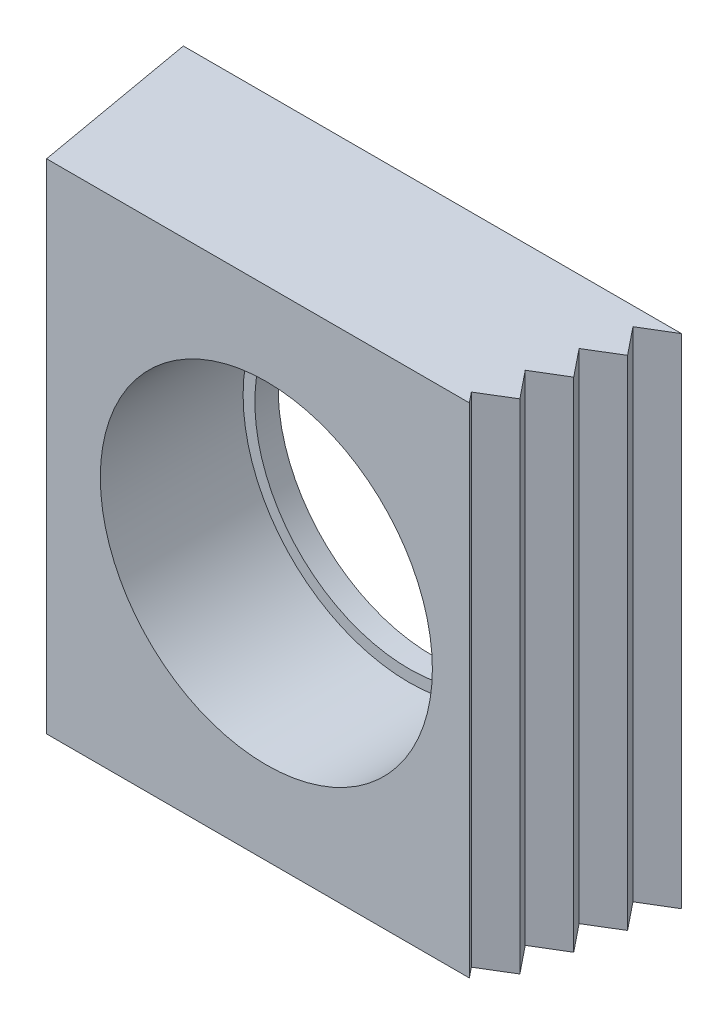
ISO-10303-21;
HEADER;
FILE_DESCRIPTION(('STEP AP214'),'2;1');
FILE_NAME('part.step','',(''),(''),'','','');
FILE_SCHEMA(('AUTOMOTIVE_DESIGN { 1 0 10303 214 1 1 1 1 }'));
ENDSEC;
DATA;
#1=APPLICATION_CONTEXT('core data for automotive mechanical design processes');
#2=APPLICATION_PROTOCOL_DEFINITION('international standard','automotive_design',2000,#1);
#3=PRODUCT_CONTEXT('',#1,'mechanical');
#4=PRODUCT('Part','Part','',(#3));
#5=PRODUCT_RELATED_PRODUCT_CATEGORY('part','',(#4));
#6=PRODUCT_DEFINITION_FORMATION('','',#4);
#7=PRODUCT_DEFINITION_CONTEXT('part definition',#1,'design');
#8=PRODUCT_DEFINITION('design','',#6,#7);
#9=PRODUCT_DEFINITION_SHAPE('','',#8);
#10=(LENGTH_UNIT() NAMED_UNIT(*) SI_UNIT(.MILLI.,.METRE.));
#11=(NAMED_UNIT(*) PLANE_ANGLE_UNIT() SI_UNIT($,.RADIAN.));
#12=(NAMED_UNIT(*) SI_UNIT($,.STERADIAN.) SOLID_ANGLE_UNIT());
#13=UNCERTAINTY_MEASURE_WITH_UNIT(LENGTH_MEASURE(1.E-05),#10,'distance_accuracy_value','');
#14=(GEOMETRIC_REPRESENTATION_CONTEXT(3) GLOBAL_UNCERTAINTY_ASSIGNED_CONTEXT((#13)) GLOBAL_UNIT_ASSIGNED_CONTEXT((#10,
#11,#12)) REPRESENTATION_CONTEXT('',''));
#15=CARTESIAN_POINT('',(0.,0.,0.));
#16=DIRECTION('',(0.,0.,1.));
#17=DIRECTION('',(1.,0.,0.));
#18=AXIS2_PLACEMENT_3D('',#15,#16,#17);
#19=CARTESIAN_POINT('',(9.525,-9.525,6.35));
#20=DIRECTION('',(0.,0.,1.));
#21=DIRECTION('',(0.,1.,0.));
#22=AXIS2_PLACEMENT_3D('',#19,#20,#21);
#23=PLANE('',#22);
#24=CARTESIAN_POINT('',(0.,0.,6.35));
#25=DIRECTION('',(0.,0.,1.));
#26=DIRECTION('',(0.,1.,0.));
#27=AXIS2_PLACEMENT_3D('',#24,#25,#26);
#28=CIRCLE('',#27,6.35);
#29=CARTESIAN_POINT('',(0.,6.35,6.35));
#30=VERTEX_POINT('',#29);
#31=EDGE_CURVE('E18',#30,#30,#28,.F.);
#32=ORIENTED_EDGE('',*,*,#31,.T.);
#33=EDGE_LOOP('',(#32));
#34=FACE_BOUND('',#33,.T.);
#35=DIRECTION('',(1.,0.,0.));
#36=VECTOR('',#35,1.);
#37=CARTESIAN_POINT('',(-9.525,-9.525,6.35));
#38=LINE('',#37,#36);
#39=CARTESIAN_POINT('',(-8.40532367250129,-9.525,6.35));
#40=VERTEX_POINT('',#39);
#41=CARTESIAN_POINT('',(7.76395811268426,-9.525,6.35));
#42=VERTEX_POINT('',#41);
#43=EDGE_CURVE('E23',#40,#42,#38,.T.);
#44=ORIENTED_EDGE('',*,*,#43,.T.);
#45=DIRECTION('',(0.,1.,0.));
#46=VECTOR('',#45,1.);
#47=CARTESIAN_POINT('',(7.76395811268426,-9.525,6.35));
#48=LINE('',#47,#46);
#49=CARTESIAN_POINT('',(7.76395811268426,9.525,6.35));
#50=VERTEX_POINT('',#49);
#51=EDGE_CURVE('E103',#42,#50,#48,.T.);
#52=ORIENTED_EDGE('',*,*,#51,.T.);
#53=DIRECTION('',(-1.,0.,0.));
#54=VECTOR('',#53,1.);
#55=CARTESIAN_POINT('',(-9.525,9.525,6.35));
#56=LINE('',#55,#54);
#57=CARTESIAN_POINT('',(-8.40532367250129,9.525,6.35));
#58=VERTEX_POINT('',#57);
#59=EDGE_CURVE('E9',#50,#58,#56,.T.);
#60=ORIENTED_EDGE('',*,*,#59,.T.);
#61=DIRECTION('',(0.,1.,0.));
#62=VECTOR('',#61,1.);
#63=CARTESIAN_POINT('',(-8.40532367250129,-9.525,6.35));
#64=LINE('',#63,#62);
#65=EDGE_CURVE('E96',#40,#58,#64,.T.);
#66=ORIENTED_EDGE('',*,*,#65,.F.);
#67=EDGE_LOOP('',(#44,#52,#60,#66));
#68=FACE_BOUND('',#67,.T.);
#69=ADVANCED_FACE('F14',(#34,#68),#23,.T.);
#70=CARTESIAN_POINT('',(-9.525,-9.525,6.35));
#71=DIRECTION('',(0.,1.,0.));
#72=DIRECTION('',(-1.,0.,0.));
#73=AXIS2_PLACEMENT_3D('',#70,#71,#72);
#74=PLANE('',#73);
#75=DIRECTION('',(0.855491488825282,0.,-0.517816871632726));
#76=VECTOR('',#75,1.);
#77=CARTESIAN_POINT('',(8.37006209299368,-9.525,0.699067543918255));
#78=LINE('',#77,#76);
#79=CARTESIAN_POINT('',(8.37006209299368,-9.525,0.699067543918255));
#80=VERTEX_POINT('',#79);
#81=CARTESIAN_POINT('',(9.525,-9.525,0.));
#82=VERTEX_POINT('',#81);
#83=EDGE_CURVE('E144',#80,#82,#78,.T.);
#84=ORIENTED_EDGE('',*,*,#83,.F.);
#85=DIRECTION('',(-0.626795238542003,0.,-0.779184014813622));
#86=VECTOR('',#85,1.);
#87=CARTESIAN_POINT('',(8.37006209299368,-9.525,0.699067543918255));
#88=LINE('',#87,#86);
#89=CARTESIAN_POINT('',(9.21625354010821,-9.525,1.75098818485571));
#90=VERTEX_POINT('',#89);
#91=EDGE_CURVE('E104',#90,#80,#88,.T.);
#92=ORIENTED_EDGE('',*,*,#91,.F.);
#93=DIRECTION('',(0.855491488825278,0.,-0.517816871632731));
#94=VECTOR('',#93,1.);
#95=CARTESIAN_POINT('',(8.06131563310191,-9.525,2.45005572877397));
#96=LINE('',#95,#94);
#97=CARTESIAN_POINT('',(8.06131563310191,-9.525,2.45005572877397));
#98=VERTEX_POINT('',#97);
#99=EDGE_CURVE('E191',#98,#90,#96,.T.);
#100=ORIENTED_EDGE('',*,*,#99,.F.);
#101=DIRECTION('',(-0.626795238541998,0.,-0.779184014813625));
#102=VECTOR('',#101,1.);
#103=CARTESIAN_POINT('',(8.06131563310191,-9.525,2.45005572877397));
#104=LINE('',#103,#102);
#105=CARTESIAN_POINT('',(8.90750708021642,-9.525,3.50197636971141));
#106=VERTEX_POINT('',#105);
#107=EDGE_CURVE('E188',#106,#98,#104,.T.);
#108=ORIENTED_EDGE('',*,*,#107,.F.);
#109=DIRECTION('',(0.855491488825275,0.,-0.517816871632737));
#110=VECTOR('',#109,1.);
#111=CARTESIAN_POINT('',(7.75256917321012,-9.525,4.20104391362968));
#112=LINE('',#111,#110);
#113=CARTESIAN_POINT('',(7.75256917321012,-9.525,4.20104391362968));
#114=VERTEX_POINT('',#113);
#115=EDGE_CURVE('E185',#114,#106,#112,.T.);
#116=ORIENTED_EDGE('',*,*,#115,.F.);
#117=DIRECTION('',(-0.626795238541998,0.,-0.779184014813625));
#118=VECTOR('',#117,1.);
#119=CARTESIAN_POINT('',(8.59876062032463,-9.525,5.25296455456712));
#120=LINE('',#119,#118);
#121=CARTESIAN_POINT('',(8.59876062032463,-9.525,5.25296455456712));
#122=VERTEX_POINT('',#121);
#123=EDGE_CURVE('E182',#122,#114,#120,.T.);
#124=ORIENTED_EDGE('',*,*,#123,.F.);
#125=DIRECTION('',(0.855491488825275,0.,-0.517816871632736));
#126=VECTOR('',#125,1.);
#127=CARTESIAN_POINT('',(7.44382271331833,-9.525,5.95203209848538));
#128=LINE('',#127,#126);
#129=CARTESIAN_POINT('',(7.44382271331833,-9.525,5.95203209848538));
#130=VERTEX_POINT('',#129);
#131=EDGE_CURVE('E179',#130,#122,#128,.T.);
#132=ORIENTED_EDGE('',*,*,#131,.F.);
#133=DIRECTION('',(-0.626795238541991,0.,-0.779184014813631));
#134=VECTOR('',#133,1.);
#135=CARTESIAN_POINT('',(7.44382271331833,-9.525,5.95203209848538));
#136=LINE('',#135,#134);
#137=EDGE_CURVE('E143',#42,#130,#136,.T.);
#138=ORIENTED_EDGE('',*,*,#137,.F.);
#139=ORIENTED_EDGE('',*,*,#43,.F.);
#140=DIRECTION('',(0.173648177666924,0.,0.984807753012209));
#141=VECTOR('',#140,1.);
#142=CARTESIAN_POINT('',(-9.525,-9.525,0.));
#143=LINE('',#142,#141);
#144=CARTESIAN_POINT('',(-9.525,-9.525,0.));
#145=VERTEX_POINT('',#144);
#146=EDGE_CURVE('E99',#145,#40,#143,.T.);
#147=ORIENTED_EDGE('',*,*,#146,.F.);
#148=DIRECTION('',(1.,0.,0.));
#149=VECTOR('',#148,1.);
#150=CARTESIAN_POINT('',(-9.525,-9.525,0.));
#151=LINE('',#150,#149);
#152=EDGE_CURVE('E131',#145,#82,#151,.T.);
#153=ORIENTED_EDGE('',*,*,#152,.T.);
#154=EDGE_LOOP('',(#84,#92,#100,#108,#116,#124,#132,#138,#139,#147,#153));
#155=FACE_BOUND('',#154,.T.);
#156=ADVANCED_FACE('F16',(#155),#74,.F.);
#157=CARTESIAN_POINT('',(-9.525,9.525,6.35));
#158=DIRECTION('',(0.,-1.,0.));
#159=DIRECTION('',(1.,0.,0.));
#160=AXIS2_PLACEMENT_3D('',#157,#158,#159);
#161=PLANE('',#160);
#162=DIRECTION('',(0.855491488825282,0.,-0.517816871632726));
#163=VECTOR('',#162,1.);
#164=CARTESIAN_POINT('',(8.37006209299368,9.525,0.699067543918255));
#165=LINE('',#164,#163);
#166=CARTESIAN_POINT('',(8.37006209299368,9.525,0.699067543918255));
#167=VERTEX_POINT('',#166);
#168=CARTESIAN_POINT('',(9.525,9.525,0.));
#169=VERTEX_POINT('',#168);
#170=EDGE_CURVE('E115',#167,#169,#165,.T.);
#171=ORIENTED_EDGE('',*,*,#170,.T.);
#172=DIRECTION('',(-1.,0.,0.));
#173=VECTOR('',#172,1.);
#174=CARTESIAN_POINT('',(-9.525,9.525,0.));
#175=LINE('',#174,#173);
#176=CARTESIAN_POINT('',(-9.525,9.525,0.));
#177=VERTEX_POINT('',#176);
#178=EDGE_CURVE('E112',#169,#177,#175,.T.);
#179=ORIENTED_EDGE('',*,*,#178,.T.);
#180=DIRECTION('',(0.173648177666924,0.,0.984807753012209));
#181=VECTOR('',#180,1.);
#182=CARTESIAN_POINT('',(-9.525,9.525,0.));
#183=LINE('',#182,#181);
#184=EDGE_CURVE('E38',#177,#58,#183,.T.);
#185=ORIENTED_EDGE('',*,*,#184,.T.);
#186=ORIENTED_EDGE('',*,*,#59,.F.);
#187=DIRECTION('',(-0.626795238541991,0.,-0.779184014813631));
#188=VECTOR('',#187,1.);
#189=CARTESIAN_POINT('',(7.44382271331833,9.525,5.95203209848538));
#190=LINE('',#189,#188);
#191=CARTESIAN_POINT('',(7.44382271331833,9.525,5.95203209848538));
#192=VERTEX_POINT('',#191);
#193=EDGE_CURVE('E114',#50,#192,#190,.T.);
#194=ORIENTED_EDGE('',*,*,#193,.T.);
#195=DIRECTION('',(0.855491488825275,0.,-0.517816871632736));
#196=VECTOR('',#195,1.);
#197=CARTESIAN_POINT('',(7.44382271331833,9.525,5.95203209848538));
#198=LINE('',#197,#196);
#199=CARTESIAN_POINT('',(8.59876062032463,9.525,5.25296455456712));
#200=VERTEX_POINT('',#199);
#201=EDGE_CURVE('E30',#192,#200,#198,.T.);
#202=ORIENTED_EDGE('',*,*,#201,.T.);
#203=DIRECTION('',(-0.626795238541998,0.,-0.779184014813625));
#204=VECTOR('',#203,1.);
#205=CARTESIAN_POINT('',(8.59876062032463,9.525,5.25296455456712));
#206=LINE('',#205,#204);
#207=CARTESIAN_POINT('',(7.75256917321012,9.525,4.20104391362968));
#208=VERTEX_POINT('',#207);
#209=EDGE_CURVE('E165',#200,#208,#206,.T.);
#210=ORIENTED_EDGE('',*,*,#209,.T.);
#211=DIRECTION('',(0.855491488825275,0.,-0.517816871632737));
#212=VECTOR('',#211,1.);
#213=CARTESIAN_POINT('',(7.75256917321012,9.525,4.20104391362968));
#214=LINE('',#213,#212);
#215=CARTESIAN_POINT('',(8.90750708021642,9.525,3.50197636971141));
#216=VERTEX_POINT('',#215);
#217=EDGE_CURVE('E168',#208,#216,#214,.T.);
#218=ORIENTED_EDGE('',*,*,#217,.T.);
#219=DIRECTION('',(-0.626795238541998,0.,-0.779184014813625));
#220=VECTOR('',#219,1.);
#221=CARTESIAN_POINT('',(8.0613156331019,9.525,2.45005572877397));
#222=LINE('',#221,#220);
#223=CARTESIAN_POINT('',(8.0613156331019,9.525,2.45005572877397));
#224=VERTEX_POINT('',#223);
#225=EDGE_CURVE('E171',#216,#224,#222,.T.);
#226=ORIENTED_EDGE('',*,*,#225,.T.);
#227=DIRECTION('',(0.855491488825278,0.,-0.517816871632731));
#228=VECTOR('',#227,1.);
#229=CARTESIAN_POINT('',(8.0613156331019,9.525,2.45005572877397));
#230=LINE('',#229,#228);
#231=CARTESIAN_POINT('',(9.21625354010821,9.525,1.75098818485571));
#232=VERTEX_POINT('',#231);
#233=EDGE_CURVE('E174',#224,#232,#230,.T.);
#234=ORIENTED_EDGE('',*,*,#233,.T.);
#235=DIRECTION('',(-0.626795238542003,0.,-0.779184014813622));
#236=VECTOR('',#235,1.);
#237=CARTESIAN_POINT('',(8.37006209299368,9.525,0.699067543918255));
#238=LINE('',#237,#236);
#239=EDGE_CURVE('E155',#232,#167,#238,.T.);
#240=ORIENTED_EDGE('',*,*,#239,.T.);
#241=EDGE_LOOP('',(#171,#179,#185,#186,#194,#202,#210,#218,#226,#234,#240));
#242=FACE_BOUND('',#241,.T.);
#243=ADVANCED_FACE('F109',(#242),#161,.F.);
#244=CARTESIAN_POINT('',(9.525,-9.525,0.));
#245=DIRECTION('',(0.,0.,1.));
#246=DIRECTION('',(0.,1.,0.));
#247=AXIS2_PLACEMENT_3D('',#244,#245,#246);
#248=PLANE('',#247);
#249=ORIENTED_EDGE('',*,*,#152,.F.);
#250=DIRECTION('',(0.,-1.,0.));
#251=VECTOR('',#250,1.);
#252=CARTESIAN_POINT('',(-9.525,-9.525,0.));
#253=LINE('',#252,#251);
#254=EDGE_CURVE('E137',#177,#145,#253,.T.);
#255=ORIENTED_EDGE('',*,*,#254,.F.);
#256=ORIENTED_EDGE('',*,*,#178,.F.);
#257=DIRECTION('',(0.,1.,0.));
#258=VECTOR('',#257,1.);
#259=CARTESIAN_POINT('',(9.525,-9.525,0.));
#260=LINE('',#259,#258);
#261=EDGE_CURVE('E134',#82,#169,#260,.T.);
#262=ORIENTED_EDGE('',*,*,#261,.F.);
#263=EDGE_LOOP('',(#249,#255,#256,#262));
#264=FACE_BOUND('',#263,.T.);
#265=CARTESIAN_POINT('',(0.,0.,0.));
#266=DIRECTION('',(0.,0.,1.));
#267=DIRECTION('',(1.,0.,0.));
#268=AXIS2_PLACEMENT_3D('',#265,#266,#267);
#269=CIRCLE('',#268,5.9);
#270=CARTESIAN_POINT('',(5.9,0.,0.));
#271=VERTEX_POINT('',#270);
#272=EDGE_CURVE('E156',#271,#271,#269,.F.);
#273=ORIENTED_EDGE('',*,*,#272,.F.);
#274=EDGE_LOOP('',(#273));
#275=FACE_BOUND('',#274,.T.);
#276=ADVANCED_FACE('F147',(#264,#275),#248,.F.);
#277=CARTESIAN_POINT('',(0.,0.,-1.87571679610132));
#278=DIRECTION('',(0.,0.,-1.));
#279=DIRECTION('',(0.,-1.,0.));
#280=AXIS2_PLACEMENT_3D('',#277,#278,#279);
#281=CYLINDRICAL_SURFACE('',#280,6.35);
#282=ORIENTED_EDGE('',*,*,#31,.F.);
#283=EDGE_LOOP('',(#282));
#284=FACE_BOUND('',#283,.T.);
#285=CARTESIAN_POINT('',(0.,0.,0.889));
#286=DIRECTION('',(0.,0.,-1.));
#287=DIRECTION('',(0.,-1.,0.));
#288=AXIS2_PLACEMENT_3D('',#285,#286,#287);
#289=CIRCLE('',#288,6.35);
#290=CARTESIAN_POINT('',(0.,-6.35,0.889));
#291=VERTEX_POINT('',#290);
#292=EDGE_CURVE('E127',#291,#291,#289,.T.);
#293=ORIENTED_EDGE('',*,*,#292,.T.);
#294=EDGE_LOOP('',(#293));
#295=FACE_BOUND('',#294,.T.);
#296=ADVANCED_FACE('F252',(#284,#295),#281,.F.);
#297=CARTESIAN_POINT('',(0.,6.35,0.889));
#298=DIRECTION('',(0.,0.,1.));
#299=DIRECTION('',(0.,1.,0.));
#300=AXIS2_PLACEMENT_3D('',#297,#298,#299);
#301=PLANE('',#300);
#302=ORIENTED_EDGE('',*,*,#292,.F.);
#303=EDGE_LOOP('',(#302));
#304=FACE_BOUND('',#303,.T.);
#305=CARTESIAN_POINT('',(0.,0.,0.889));
#306=DIRECTION('',(0.,0.,1.));
#307=DIRECTION('',(1.,0.,0.));
#308=AXIS2_PLACEMENT_3D('',#305,#306,#307);
#309=CIRCLE('',#308,5.9);
#310=CARTESIAN_POINT('',(5.9,0.,0.889));
#311=VERTEX_POINT('',#310);
#312=EDGE_CURVE('E159',#311,#311,#309,.T.);
#313=ORIENTED_EDGE('',*,*,#312,.F.);
#314=EDGE_LOOP('',(#313));
#315=FACE_BOUND('',#314,.T.);
#316=ADVANCED_FACE('F257',(#304,#315),#301,.T.);
#317=CARTESIAN_POINT('',(-9.525,-9.525,0.));
#318=DIRECTION('',(-0.984807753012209,0.,0.173648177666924));
#319=DIRECTION('',(0.173648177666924,0.,0.984807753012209));
#320=AXIS2_PLACEMENT_3D('',#317,#318,#319);
#321=PLANE('',#320);
#322=ORIENTED_EDGE('',*,*,#184,.F.);
#323=ORIENTED_EDGE('',*,*,#254,.T.);
#324=ORIENTED_EDGE('',*,*,#146,.T.);
#325=ORIENTED_EDGE('',*,*,#65,.T.);
#326=EDGE_LOOP('',(#322,#323,#324,#325));
#327=FACE_BOUND('',#326,.T.);
#328=ADVANCED_FACE('F97',(#327),#321,.T.);
#329=CARTESIAN_POINT('',(8.37006209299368,-9.525,0.699067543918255));
#330=DIRECTION('',(0.517816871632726,0.,0.855491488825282));
#331=DIRECTION('',(0.855491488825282,0.,-0.517816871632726));
#332=AXIS2_PLACEMENT_3D('',#329,#330,#331);
#333=PLANE('',#332);
#334=ORIENTED_EDGE('',*,*,#170,.F.);
#335=DIRECTION('',(0.,1.,0.));
#336=VECTOR('',#335,1.);
#337=CARTESIAN_POINT('',(8.37006209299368,-9.525,0.699067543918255));
#338=LINE('',#337,#336);
#339=EDGE_CURVE('E130',#80,#167,#338,.T.);
#340=ORIENTED_EDGE('',*,*,#339,.F.);
#341=ORIENTED_EDGE('',*,*,#83,.T.);
#342=ORIENTED_EDGE('',*,*,#261,.T.);
#343=EDGE_LOOP('',(#334,#340,#341,#342));
#344=FACE_BOUND('',#343,.T.);
#345=ADVANCED_FACE('F151',(#344),#333,.T.);
#346=CARTESIAN_POINT('',(8.37006209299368,-9.525,0.699067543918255));
#347=DIRECTION('',(0.779184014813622,0.,-0.626795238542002));
#348=DIRECTION('',(-0.626795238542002,0.,-0.779184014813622));
#349=AXIS2_PLACEMENT_3D('',#346,#347,#348);
#350=PLANE('',#349);
#351=ORIENTED_EDGE('',*,*,#239,.F.);
#352=DIRECTION('',(0.,1.,0.));
#353=VECTOR('',#352,1.);
#354=CARTESIAN_POINT('',(9.21625354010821,-9.525,1.75098818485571));
#355=LINE('',#354,#353);
#356=EDGE_CURVE('E197',#90,#232,#355,.T.);
#357=ORIENTED_EDGE('',*,*,#356,.F.);
#358=ORIENTED_EDGE('',*,*,#91,.T.);
#359=ORIENTED_EDGE('',*,*,#339,.T.);
#360=EDGE_LOOP('',(#351,#357,#358,#359));
#361=FACE_BOUND('',#360,.T.);
#362=ADVANCED_FACE('F225',(#361),#350,.T.);
#363=CARTESIAN_POINT('',(8.06131563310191,-9.525,2.45005572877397));
#364=DIRECTION('',(0.517816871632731,0.,0.855491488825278));
#365=DIRECTION('',(0.855491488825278,0.,-0.517816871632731));
#366=AXIS2_PLACEMENT_3D('',#363,#364,#365);
#367=PLANE('',#366);
#368=ORIENTED_EDGE('',*,*,#233,.F.);
#369=DIRECTION('',(0.,1.,0.));
#370=VECTOR('',#369,1.);
#371=CARTESIAN_POINT('',(8.06131563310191,-9.525,2.45005572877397));
#372=LINE('',#371,#370);
#373=EDGE_CURVE('E199',#98,#224,#372,.T.);
#374=ORIENTED_EDGE('',*,*,#373,.F.);
#375=ORIENTED_EDGE('',*,*,#99,.T.);
#376=ORIENTED_EDGE('',*,*,#356,.T.);
#377=EDGE_LOOP('',(#368,#374,#375,#376));
#378=FACE_BOUND('',#377,.T.);
#379=ADVANCED_FACE('F222',(#378),#367,.T.);
#380=CARTESIAN_POINT('',(8.06131563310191,-9.525,2.45005572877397));
#381=DIRECTION('',(0.779184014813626,0.,-0.626795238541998));
#382=DIRECTION('',(-0.626795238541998,0.,-0.779184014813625));
#383=AXIS2_PLACEMENT_3D('',#380,#381,#382);
#384=PLANE('',#383);
#385=ORIENTED_EDGE('',*,*,#225,.F.);
#386=DIRECTION('',(0.,1.,0.));
#387=VECTOR('',#386,1.);
#388=CARTESIAN_POINT('',(8.90750708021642,-9.525,3.50197636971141));
#389=LINE('',#388,#387);
#390=EDGE_CURVE('E201',#106,#216,#389,.T.);
#391=ORIENTED_EDGE('',*,*,#390,.F.);
#392=ORIENTED_EDGE('',*,*,#107,.T.);
#393=ORIENTED_EDGE('',*,*,#373,.T.);
#394=EDGE_LOOP('',(#385,#391,#392,#393));
#395=FACE_BOUND('',#394,.T.);
#396=ADVANCED_FACE('F220',(#395),#384,.T.);
#397=CARTESIAN_POINT('',(7.75256917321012,-9.525,4.20104391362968));
#398=DIRECTION('',(0.517816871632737,0.,0.855491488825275));
#399=DIRECTION('',(0.855491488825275,0.,-0.517816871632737));
#400=AXIS2_PLACEMENT_3D('',#397,#398,#399);
#401=PLANE('',#400);
#402=ORIENTED_EDGE('',*,*,#217,.F.);
#403=DIRECTION('',(0.,1.,0.));
#404=VECTOR('',#403,1.);
#405=CARTESIAN_POINT('',(7.75256917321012,-9.525,4.20104391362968));
#406=LINE('',#405,#404);
#407=EDGE_CURVE('E203',#114,#208,#406,.T.);
#408=ORIENTED_EDGE('',*,*,#407,.F.);
#409=ORIENTED_EDGE('',*,*,#115,.T.);
#410=ORIENTED_EDGE('',*,*,#390,.T.);
#411=EDGE_LOOP('',(#402,#408,#409,#410));
#412=FACE_BOUND('',#411,.T.);
#413=ADVANCED_FACE('F216',(#412),#401,.T.);
#414=CARTESIAN_POINT('',(8.59876062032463,-9.525,5.25296455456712));
#415=DIRECTION('',(0.779184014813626,0.,-0.626795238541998));
#416=DIRECTION('',(-0.626795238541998,0.,-0.779184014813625));
#417=AXIS2_PLACEMENT_3D('',#414,#415,#416);
#418=PLANE('',#417);
#419=ORIENTED_EDGE('',*,*,#209,.F.);
#420=DIRECTION('',(0.,1.,0.));
#421=VECTOR('',#420,1.);
#422=CARTESIAN_POINT('',(8.59876062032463,-9.525,5.25296455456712));
#423=LINE('',#422,#421);
#424=EDGE_CURVE('E123',#122,#200,#423,.T.);
#425=ORIENTED_EDGE('',*,*,#424,.F.);
#426=ORIENTED_EDGE('',*,*,#123,.T.);
#427=ORIENTED_EDGE('',*,*,#407,.T.);
#428=EDGE_LOOP('',(#419,#425,#426,#427));
#429=FACE_BOUND('',#428,.T.);
#430=ADVANCED_FACE('F209',(#429),#418,.T.);
#431=CARTESIAN_POINT('',(7.44382271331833,-9.525,5.95203209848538));
#432=DIRECTION('',(0.517816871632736,0.,0.855491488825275));
#433=DIRECTION('',(0.855491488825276,0.,-0.517816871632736));
#434=AXIS2_PLACEMENT_3D('',#431,#432,#433);
#435=PLANE('',#434);
#436=ORIENTED_EDGE('',*,*,#201,.F.);
#437=DIRECTION('',(0.,1.,0.));
#438=VECTOR('',#437,1.);
#439=CARTESIAN_POINT('',(7.44382271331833,-9.525,5.95203209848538));
#440=LINE('',#439,#438);
#441=EDGE_CURVE('E121',#130,#192,#440,.T.);
#442=ORIENTED_EDGE('',*,*,#441,.F.);
#443=ORIENTED_EDGE('',*,*,#131,.T.);
#444=ORIENTED_EDGE('',*,*,#424,.T.);
#445=EDGE_LOOP('',(#436,#442,#443,#444));
#446=FACE_BOUND('',#445,.T.);
#447=ADVANCED_FACE('F205',(#446),#435,.T.);
#448=CARTESIAN_POINT('',(7.44382271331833,-9.525,5.95203209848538));
#449=DIRECTION('',(0.779184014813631,0.,-0.626795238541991));
#450=DIRECTION('',(-0.626795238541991,0.,-0.779184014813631));
#451=AXIS2_PLACEMENT_3D('',#448,#449,#450);
#452=PLANE('',#451);
#453=ORIENTED_EDGE('',*,*,#193,.F.);
#454=ORIENTED_EDGE('',*,*,#51,.F.);
#455=ORIENTED_EDGE('',*,*,#137,.T.);
#456=ORIENTED_EDGE('',*,*,#441,.T.);
#457=EDGE_LOOP('',(#453,#454,#455,#456));
#458=FACE_BOUND('',#457,.T.);
#459=ADVANCED_FACE('F211',(#458),#452,.T.);
#460=CARTESIAN_POINT('',(0.,0.,-17.9605122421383));
#461=DIRECTION('',(0.,0.,1.));
#462=DIRECTION('',(1.,0.,0.));
#463=AXIS2_PLACEMENT_3D('',#460,#461,#462);
#464=CYLINDRICAL_SURFACE('',#463,5.9);
#465=ORIENTED_EDGE('',*,*,#272,.T.);
#466=EDGE_LOOP('',(#465));
#467=FACE_BOUND('',#466,.T.);
#468=ORIENTED_EDGE('',*,*,#312,.T.);
#469=EDGE_LOOP('',(#468));
#470=FACE_BOUND('',#469,.T.);
#471=ADVANCED_FACE('F272',(#467,#470),#464,.F.);
#472=CLOSED_SHELL('',(#69,#156,#243,#276,#296,#316,#328,#345,#362,#379,#396,#413,#430,#447,#459,#471));
#473=MANIFOLD_SOLID_BREP('B1',#472);
#474=ADVANCED_BREP_SHAPE_REPRESENTATION('',(#18,#473),#14);
#475=SHAPE_DEFINITION_REPRESENTATION(#9,#474);
ENDSEC;
END-ISO-10303-21;
